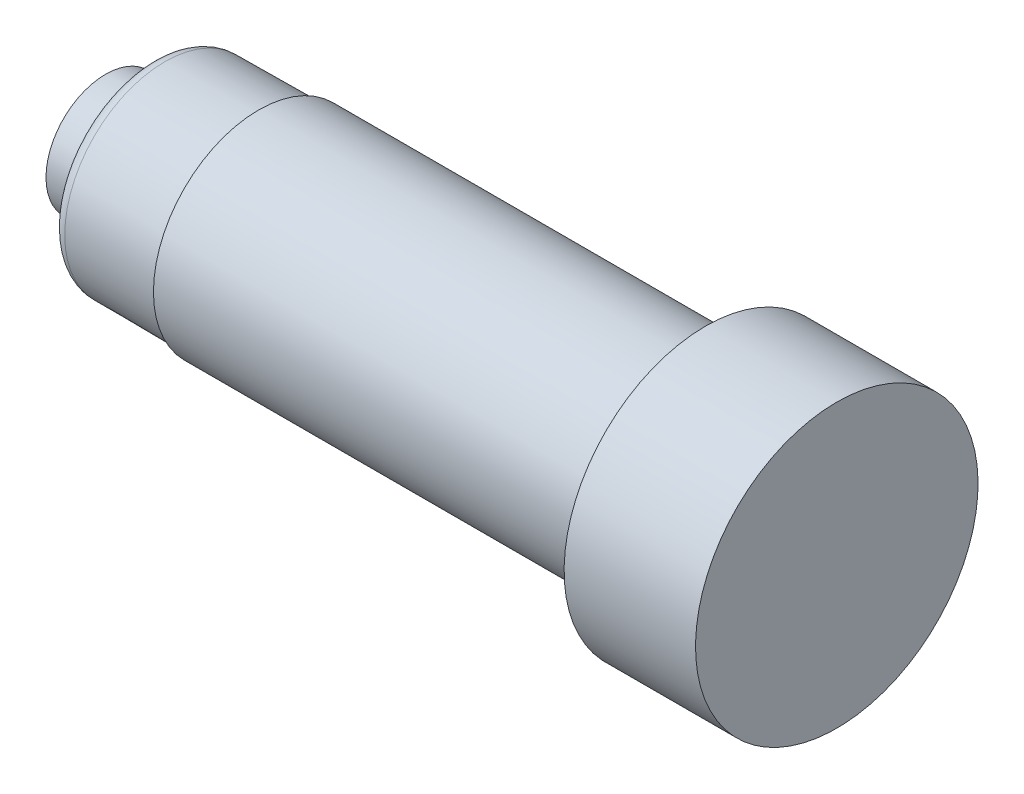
from build123d import *

# Parameters (mm, degrees)
CONG_1_R                = 0.5
ESQUISSE2_R             = 6.385860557
ENL_V_MAT_EXTRU_1_DEPTH = 0.25


with BuildPart() as part:
    # Esquisse1 → R_volution1 (revolve)
    with BuildSketch(Plane.XY):
        Polygon((87, 5.375), (82, 5.375), (82, 4), (65, 4), (65, 3.841681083), (60.94, 3.80625), (60.94, 2.283576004), (58.93, 2.266035), (58.93, 0), (87, 0), align=None)
    revolve(axis=Axis((93, 0, 0), (-1, 0, 0)))

    # Cong_1
    cong_1_edges = [part.edges().sort_by_distance(p)[0] for p in [
        (82, -4, 0),
        (60.94, -2.283576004, 0),
        (60.94, -3.80625, 0),
    ]]
    fillet(cong_1_edges, radius=CONG_1_R)

    # Esquisse2 → Enl_v. mat.-Extru.1 (cut)
    with BuildSketch(Plane.ZY.offset(-58.93)):
        Circle(ESQUISSE2_R)
    extrude(amount=-ENL_V_MAT_EXTRU_1_DEPTH, mode=Mode.SUBTRACT)


solid = part.part
